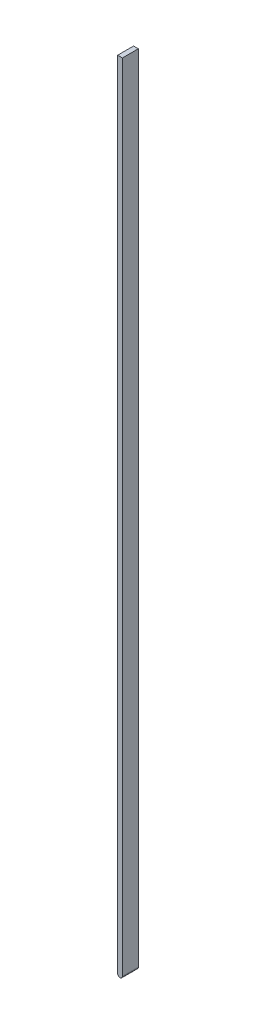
from build123d import *

# Parameters (mm, degrees)
EXTRUDE1_DEPTH      = 10
EXTRUDE1_DEPTH_BACK = 10


with BuildPart() as part:
    # Sketch1 → Extrude1 (new, two sides: drawn at the far end of the back side and taken through both)
    with BuildSketch(Plane.XY.offset(-EXTRUDE1_DEPTH_BACK)):
        with BuildLine():
            Line((3, 0), (3, 1000))
            Line((3, 1000), (-3, 1000))
            Line((-3, 1000), (-3, 0))
            ThreePointArc((-3, 0), (0, -3), (3, 0))
        make_face()
    extrude(amount=EXTRUDE1_DEPTH + EXTRUDE1_DEPTH_BACK)


solid = part.part
